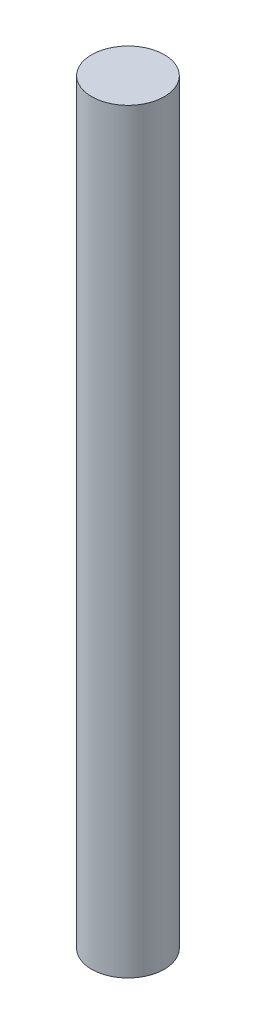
from build123d import *

# Parameters (mm, degrees)
SKETCH1_R           = 0.79375
BOSS_EXTRUDE1_DEPTH = 16.51


with BuildPart() as part:
    # Sketch1 → Boss-Extrude1 (new body)
    with BuildSketch(Plane(origin=(0, 0, 0), x_dir=(1, 0, 0), z_dir=(0, 1, 0))):
        with Locations(Location((0, 0, 0), (0, 0, 270))):
            Circle(SKETCH1_R)
    extrude(amount=BOSS_EXTRUDE1_DEPTH)


solid = part.part
